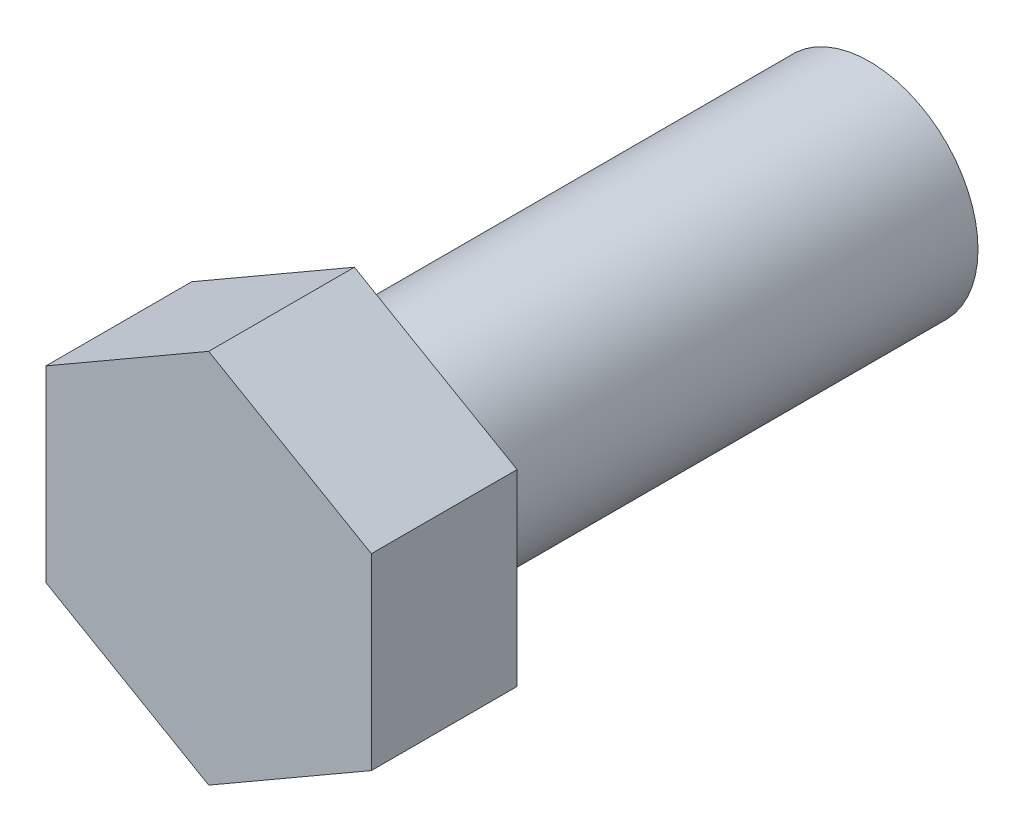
ISO-10303-21;
HEADER;
FILE_DESCRIPTION(('STEP AP214'),'2;1');
FILE_NAME('part.step','',(''),(''),'','','');
FILE_SCHEMA(('AUTOMOTIVE_DESIGN { 1 0 10303 214 1 1 1 1 }'));
ENDSEC;
DATA;
#1=APPLICATION_CONTEXT('core data for automotive mechanical design processes');
#2=APPLICATION_PROTOCOL_DEFINITION('international standard','automotive_design',2000,#1);
#3=PRODUCT_CONTEXT('',#1,'mechanical');
#4=PRODUCT('Part','Part','',(#3));
#5=PRODUCT_RELATED_PRODUCT_CATEGORY('part','',(#4));
#6=PRODUCT_DEFINITION_FORMATION('','',#4);
#7=PRODUCT_DEFINITION_CONTEXT('part definition',#1,'design');
#8=PRODUCT_DEFINITION('design','',#6,#7);
#9=PRODUCT_DEFINITION_SHAPE('','',#8);
#10=(LENGTH_UNIT() NAMED_UNIT(*) SI_UNIT(.MILLI.,.METRE.));
#11=(NAMED_UNIT(*) PLANE_ANGLE_UNIT() SI_UNIT($,.RADIAN.));
#12=(NAMED_UNIT(*) SI_UNIT($,.STERADIAN.) SOLID_ANGLE_UNIT());
#13=UNCERTAINTY_MEASURE_WITH_UNIT(LENGTH_MEASURE(1.E-05),#10,'distance_accuracy_value','');
#14=(GEOMETRIC_REPRESENTATION_CONTEXT(3) GLOBAL_UNCERTAINTY_ASSIGNED_CONTEXT((#13)) GLOBAL_UNIT_ASSIGNED_CONTEXT((#10,
#11,#12)) REPRESENTATION_CONTEXT('',''));
#15=CARTESIAN_POINT('',(0.,0.,0.));
#16=DIRECTION('',(0.,0.,1.));
#17=DIRECTION('',(1.,0.,0.));
#18=AXIS2_PLACEMENT_3D('',#15,#16,#17);
#19=CARTESIAN_POINT('',(76.2,43.9940905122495,68.2625));
#20=DIRECTION('',(-0.5,-0.866025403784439,0.));
#21=DIRECTION('',(0.866025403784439,-0.5,0.));
#22=AXIS2_PLACEMENT_3D('',#19,#20,#21);
#23=PLANE('',#22);
#24=DIRECTION('',(-0.866025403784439,0.5,0.));
#25=VECTOR('',#24,1.);
#26=CARTESIAN_POINT('',(76.2,43.9940905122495,0.));
#27=LINE('',#26,#25);
#28=CARTESIAN_POINT('',(76.2,43.9940905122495,0.));
#29=VERTEX_POINT('',#28);
#30=CARTESIAN_POINT('',(0.,87.988181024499,0.));
#31=VERTEX_POINT('',#30);
#32=EDGE_CURVE('E128',#29,#31,#27,.T.);
#33=ORIENTED_EDGE('',*,*,#32,.T.);
#34=DIRECTION('',(0.,0.,-1.));
#35=VECTOR('',#34,1.);
#36=CARTESIAN_POINT('',(0.,87.988181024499,68.2625));
#37=LINE('',#36,#35);
#38=CARTESIAN_POINT('',(0.,87.988181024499,68.2625));
#39=VERTEX_POINT('',#38);
#40=EDGE_CURVE('E11',#39,#31,#37,.T.);
#41=ORIENTED_EDGE('',*,*,#40,.F.);
#42=DIRECTION('',(-0.866025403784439,0.5,0.));
#43=VECTOR('',#42,1.);
#44=CARTESIAN_POINT('',(76.2,43.9940905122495,68.2625));
#45=LINE('',#44,#43);
#46=CARTESIAN_POINT('',(76.2,43.9940905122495,68.2625));
#47=VERTEX_POINT('',#46);
#48=EDGE_CURVE('E140',#47,#39,#45,.T.);
#49=ORIENTED_EDGE('',*,*,#48,.F.);
#50=DIRECTION('',(0.,0.,-1.));
#51=VECTOR('',#50,1.);
#52=CARTESIAN_POINT('',(76.2,43.9940905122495,68.2625));
#53=LINE('',#52,#51);
#54=EDGE_CURVE('E122',#47,#29,#53,.T.);
#55=ORIENTED_EDGE('',*,*,#54,.T.);
#56=EDGE_LOOP('',(#33,#41,#49,#55));
#57=FACE_BOUND('',#56,.T.);
#58=ADVANCED_FACE('F45',(#57),#23,.F.);
#59=CARTESIAN_POINT('',(0.,87.988181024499,68.2625));
#60=DIRECTION('',(0.5,-0.866025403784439,0.));
#61=DIRECTION('',(0.866025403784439,0.5,0.));
#62=AXIS2_PLACEMENT_3D('',#59,#60,#61);
#63=PLANE('',#62);
#64=DIRECTION('',(-0.866025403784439,-0.5,0.));
#65=VECTOR('',#64,1.);
#66=CARTESIAN_POINT('',(0.,87.988181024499,0.));
#67=LINE('',#66,#65);
#68=CARTESIAN_POINT('',(-76.2,43.9940905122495,0.));
#69=VERTEX_POINT('',#68);
#70=EDGE_CURVE('E129',#31,#69,#67,.T.);
#71=ORIENTED_EDGE('',*,*,#70,.T.);
#72=DIRECTION('',(0.,0.,-1.));
#73=VECTOR('',#72,1.);
#74=CARTESIAN_POINT('',(-76.2,43.9940905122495,68.2625));
#75=LINE('',#74,#73);
#76=CARTESIAN_POINT('',(-76.2,43.9940905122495,68.2625));
#77=VERTEX_POINT('',#76);
#78=EDGE_CURVE('E49',#77,#69,#75,.T.);
#79=ORIENTED_EDGE('',*,*,#78,.F.);
#80=DIRECTION('',(-0.866025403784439,-0.5,0.));
#81=VECTOR('',#80,1.);
#82=CARTESIAN_POINT('',(0.,87.988181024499,68.2625));
#83=LINE('',#82,#81);
#84=EDGE_CURVE('E94',#39,#77,#83,.T.);
#85=ORIENTED_EDGE('',*,*,#84,.F.);
#86=ORIENTED_EDGE('',*,*,#40,.T.);
#87=EDGE_LOOP('',(#71,#79,#85,#86));
#88=FACE_BOUND('',#87,.T.);
#89=ADVANCED_FACE('F163',(#88),#63,.F.);
#90=CARTESIAN_POINT('',(-76.2,43.9940905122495,68.2625));
#91=DIRECTION('',(1.,0.,0.));
#92=DIRECTION('',(0.,1.,0.));
#93=AXIS2_PLACEMENT_3D('',#90,#91,#92);
#94=PLANE('',#93);
#95=DIRECTION('',(0.,-1.,0.));
#96=VECTOR('',#95,1.);
#97=CARTESIAN_POINT('',(-76.2,43.9940905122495,0.));
#98=LINE('',#97,#96);
#99=CARTESIAN_POINT('',(-76.2,-43.9940905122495,0.));
#100=VERTEX_POINT('',#99);
#101=EDGE_CURVE('E135',#69,#100,#98,.T.);
#102=ORIENTED_EDGE('',*,*,#101,.T.);
#103=DIRECTION('',(0.,0.,-1.));
#104=VECTOR('',#103,1.);
#105=CARTESIAN_POINT('',(-76.2,-43.9940905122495,68.2625));
#106=LINE('',#105,#104);
#107=CARTESIAN_POINT('',(-76.2,-43.9940905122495,68.2625));
#108=VERTEX_POINT('',#107);
#109=EDGE_CURVE('E120',#108,#100,#106,.T.);
#110=ORIENTED_EDGE('',*,*,#109,.F.);
#111=DIRECTION('',(0.,-1.,0.));
#112=VECTOR('',#111,1.);
#113=CARTESIAN_POINT('',(-76.2,43.9940905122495,68.2625));
#114=LINE('',#113,#112);
#115=EDGE_CURVE('E106',#77,#108,#114,.T.);
#116=ORIENTED_EDGE('',*,*,#115,.F.);
#117=ORIENTED_EDGE('',*,*,#78,.T.);
#118=EDGE_LOOP('',(#102,#110,#116,#117));
#119=FACE_BOUND('',#118,.T.);
#120=ADVANCED_FACE('F142',(#119),#94,.F.);
#121=CARTESIAN_POINT('',(-76.2,-43.9940905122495,68.2625));
#122=DIRECTION('',(0.5,0.866025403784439,0.));
#123=DIRECTION('',(-0.866025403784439,0.5,0.));
#124=AXIS2_PLACEMENT_3D('',#121,#122,#123);
#125=PLANE('',#124);
#126=DIRECTION('',(0.866025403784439,-0.5,0.));
#127=VECTOR('',#126,1.);
#128=CARTESIAN_POINT('',(-76.2,-43.9940905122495,0.));
#129=LINE('',#128,#127);
#130=CARTESIAN_POINT('',(0.,-87.988181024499,0.));
#131=VERTEX_POINT('',#130);
#132=EDGE_CURVE('E118',#100,#131,#129,.T.);
#133=ORIENTED_EDGE('',*,*,#132,.T.);
#134=DIRECTION('',(0.,0.,-1.));
#135=VECTOR('',#134,1.);
#136=CARTESIAN_POINT('',(0.,-87.988181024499,68.2625));
#137=LINE('',#136,#135);
#138=CARTESIAN_POINT('',(0.,-87.988181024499,68.2625));
#139=VERTEX_POINT('',#138);
#140=EDGE_CURVE('E111',#139,#131,#137,.T.);
#141=ORIENTED_EDGE('',*,*,#140,.F.);
#142=DIRECTION('',(0.866025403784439,-0.5,0.));
#143=VECTOR('',#142,1.);
#144=CARTESIAN_POINT('',(-76.2,-43.9940905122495,68.2625));
#145=LINE('',#144,#143);
#146=EDGE_CURVE('E105',#108,#139,#145,.T.);
#147=ORIENTED_EDGE('',*,*,#146,.F.);
#148=ORIENTED_EDGE('',*,*,#109,.T.);
#149=EDGE_LOOP('',(#133,#141,#147,#148));
#150=FACE_BOUND('',#149,.T.);
#151=ADVANCED_FACE('F114',(#150),#125,.F.);
#152=CARTESIAN_POINT('',(0.,-87.988181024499,68.2625));
#153=DIRECTION('',(-0.5,0.866025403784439,0.));
#154=DIRECTION('',(-0.866025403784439,-0.5,0.));
#155=AXIS2_PLACEMENT_3D('',#152,#153,#154);
#156=PLANE('',#155);
#157=DIRECTION('',(0.866025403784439,0.5,0.));
#158=VECTOR('',#157,1.);
#159=CARTESIAN_POINT('',(0.,-87.988181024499,0.));
#160=LINE('',#159,#158);
#161=CARTESIAN_POINT('',(76.2,-43.9940905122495,0.));
#162=VERTEX_POINT('',#161);
#163=EDGE_CURVE('E83',#131,#162,#160,.T.);
#164=ORIENTED_EDGE('',*,*,#163,.T.);
#165=DIRECTION('',(0.,0.,-1.));
#166=VECTOR('',#165,1.);
#167=CARTESIAN_POINT('',(76.2,-43.9940905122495,68.2625));
#168=LINE('',#167,#166);
#169=CARTESIAN_POINT('',(76.2,-43.9940905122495,68.2625));
#170=VERTEX_POINT('',#169);
#171=EDGE_CURVE('E116',#170,#162,#168,.T.);
#172=ORIENTED_EDGE('',*,*,#171,.F.);
#173=DIRECTION('',(0.866025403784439,0.5,0.));
#174=VECTOR('',#173,1.);
#175=CARTESIAN_POINT('',(0.,-87.988181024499,68.2625));
#176=LINE('',#175,#174);
#177=EDGE_CURVE('E108',#139,#170,#176,.T.);
#178=ORIENTED_EDGE('',*,*,#177,.F.);
#179=ORIENTED_EDGE('',*,*,#140,.T.);
#180=EDGE_LOOP('',(#164,#172,#178,#179));
#181=FACE_BOUND('',#180,.T.);
#182=ADVANCED_FACE('F119',(#181),#156,.F.);
#183=CARTESIAN_POINT('',(76.2,-43.9940905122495,68.2625));
#184=DIRECTION('',(-1.,0.,0.));
#185=DIRECTION('',(0.,0.,1.));
#186=AXIS2_PLACEMENT_3D('',#183,#184,#185);
#187=PLANE('',#186);
#188=DIRECTION('',(0.,1.,0.));
#189=VECTOR('',#188,1.);
#190=CARTESIAN_POINT('',(76.2,-43.9940905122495,0.));
#191=LINE('',#190,#189);
#192=EDGE_CURVE('E90',#162,#29,#191,.T.);
#193=ORIENTED_EDGE('',*,*,#192,.T.);
#194=ORIENTED_EDGE('',*,*,#54,.F.);
#195=DIRECTION('',(0.,1.,0.));
#196=VECTOR('',#195,1.);
#197=CARTESIAN_POINT('',(76.2,-43.9940905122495,68.2625));
#198=LINE('',#197,#196);
#199=EDGE_CURVE('E59',#170,#47,#198,.T.);
#200=ORIENTED_EDGE('',*,*,#199,.F.);
#201=ORIENTED_EDGE('',*,*,#171,.T.);
#202=EDGE_LOOP('',(#193,#194,#200,#201));
#203=FACE_BOUND('',#202,.T.);
#204=ADVANCED_FACE('F148',(#203),#187,.F.);
#205=CARTESIAN_POINT('',(0.,0.,68.2625));
#206=DIRECTION('',(0.,0.,1.));
#207=DIRECTION('',(1.,0.,0.));
#208=AXIS2_PLACEMENT_3D('',#205,#206,#207);
#209=PLANE('',#208);
#210=ORIENTED_EDGE('',*,*,#48,.T.);
#211=ORIENTED_EDGE('',*,*,#84,.T.);
#212=ORIENTED_EDGE('',*,*,#115,.T.);
#213=ORIENTED_EDGE('',*,*,#146,.T.);
#214=ORIENTED_EDGE('',*,*,#177,.T.);
#215=ORIENTED_EDGE('',*,*,#199,.T.);
#216=EDGE_LOOP('',(#210,#211,#212,#213,#214,#215));
#217=FACE_BOUND('',#216,.T.);
#218=ADVANCED_FACE('F101',(#217),#209,.T.);
#219=CARTESIAN_POINT('',(0.,0.,0.));
#220=DIRECTION('',(0.,0.,1.));
#221=DIRECTION('',(1.,0.,0.));
#222=AXIS2_PLACEMENT_3D('',#219,#220,#221);
#223=PLANE('',#222);
#224=CARTESIAN_POINT('',(0.,0.,0.));
#225=DIRECTION('',(0.,0.,1.));
#226=DIRECTION('',(1.,0.,0.));
#227=AXIS2_PLACEMENT_3D('',#224,#225,#226);
#228=CIRCLE('',#227,50.8);
#229=CARTESIAN_POINT('',(50.8,0.,0.));
#230=VERTEX_POINT('',#229);
#231=EDGE_CURVE('E222',#230,#230,#228,.T.);
#232=ORIENTED_EDGE('',*,*,#231,.T.);
#233=EDGE_LOOP('',(#232));
#234=FACE_BOUND('',#233,.T.);
#235=ORIENTED_EDGE('',*,*,#32,.F.);
#236=ORIENTED_EDGE('',*,*,#192,.F.);
#237=ORIENTED_EDGE('',*,*,#163,.F.);
#238=ORIENTED_EDGE('',*,*,#132,.F.);
#239=ORIENTED_EDGE('',*,*,#101,.F.);
#240=ORIENTED_EDGE('',*,*,#70,.F.);
#241=EDGE_LOOP('',(#235,#236,#237,#238,#239,#240));
#242=FACE_BOUND('',#241,.T.);
#243=ADVANCED_FACE('F147',(#234,#242),#223,.F.);
#244=CARTESIAN_POINT('',(0.,0.,-241.3));
#245=DIRECTION('',(0.,0.,1.));
#246=DIRECTION('',(1.,0.,0.));
#247=AXIS2_PLACEMENT_3D('',#244,#245,#246);
#248=CYLINDRICAL_SURFACE('',#247,50.8);
#249=CARTESIAN_POINT('',(0.,0.,-241.3));
#250=DIRECTION('',(0.,0.,1.));
#251=DIRECTION('',(1.,0.,0.));
#252=AXIS2_PLACEMENT_3D('',#249,#250,#251);
#253=CIRCLE('',#252,50.8);
#254=CARTESIAN_POINT('',(50.8,0.,-241.3));
#255=VERTEX_POINT('',#254);
#256=EDGE_CURVE('E127',#255,#255,#253,.T.);
#257=CARTESIAN_POINT('',(50.8,0.,-241.3));
#258=CARTESIAN_POINT('',(50.8,0.,-238.786458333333));
#259=CARTESIAN_POINT('',(50.8,0.,-236.272916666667));
#260=CARTESIAN_POINT('',(50.8,0.,-231.245833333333));
#261=CARTESIAN_POINT('',(50.8,0.,-228.732291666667));
#262=CARTESIAN_POINT('',(50.8,0.,-223.705208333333));
#263=CARTESIAN_POINT('',(50.8,0.,-221.191666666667));
#264=CARTESIAN_POINT('',(50.8,0.,-216.164583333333));
#265=CARTESIAN_POINT('',(50.8,0.,-213.651041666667));
#266=CARTESIAN_POINT('',(50.8,0.,-208.623958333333));
#267=CARTESIAN_POINT('',(50.8,0.,-206.110416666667));
#268=CARTESIAN_POINT('',(50.8,0.,-201.083333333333));
#269=CARTESIAN_POINT('',(50.8,0.,-198.569791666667));
#270=CARTESIAN_POINT('',(50.8,0.,-193.542708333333));
#271=CARTESIAN_POINT('',(50.8,0.,-191.029166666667));
#272=CARTESIAN_POINT('',(50.8,0.,-186.002083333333));
#273=CARTESIAN_POINT('',(50.8,0.,-183.488541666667));
#274=CARTESIAN_POINT('',(50.8,0.,-178.461458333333));
#275=CARTESIAN_POINT('',(50.8,0.,-175.947916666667));
#276=CARTESIAN_POINT('',(50.8,0.,-170.920833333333));
#277=CARTESIAN_POINT('',(50.8,0.,-168.407291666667));
#278=CARTESIAN_POINT('',(50.8,0.,-163.380208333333));
#279=CARTESIAN_POINT('',(50.8,0.,-160.866666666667));
#280=CARTESIAN_POINT('',(50.8,0.,-155.839583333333));
#281=CARTESIAN_POINT('',(50.8,0.,-153.326041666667));
#282=CARTESIAN_POINT('',(50.8,0.,-148.298958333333));
#283=CARTESIAN_POINT('',(50.8,0.,-145.785416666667));
#284=CARTESIAN_POINT('',(50.8,0.,-140.758333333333));
#285=CARTESIAN_POINT('',(50.8,0.,-138.244791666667));
#286=CARTESIAN_POINT('',(50.8,0.,-133.217708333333));
#287=CARTESIAN_POINT('',(50.8,0.,-130.704166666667));
#288=CARTESIAN_POINT('',(50.8,0.,-125.677083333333));
#289=CARTESIAN_POINT('',(50.8,0.,-123.163541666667));
#290=CARTESIAN_POINT('',(50.8,0.,-118.136458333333));
#291=CARTESIAN_POINT('',(50.8,0.,-115.622916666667));
#292=CARTESIAN_POINT('',(50.8,0.,-110.595833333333));
#293=CARTESIAN_POINT('',(50.8,0.,-108.082291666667));
#294=CARTESIAN_POINT('',(50.8,0.,-103.055208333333));
#295=CARTESIAN_POINT('',(50.8,0.,-100.541666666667));
#296=CARTESIAN_POINT('',(50.8,0.,-95.5145833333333));
#297=CARTESIAN_POINT('',(50.8,0.,-93.0010416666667));
#298=CARTESIAN_POINT('',(50.8,0.,-87.9739583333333));
#299=CARTESIAN_POINT('',(50.8,0.,-85.4604166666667));
#300=CARTESIAN_POINT('',(50.8,0.,-80.4333333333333));
#301=CARTESIAN_POINT('',(50.8,0.,-77.9197916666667));
#302=CARTESIAN_POINT('',(50.8,0.,-72.8927083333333));
#303=CARTESIAN_POINT('',(50.8,0.,-70.3791666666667));
#304=CARTESIAN_POINT('',(50.8,0.,-65.3520833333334));
#305=CARTESIAN_POINT('',(50.8,0.,-62.8385416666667));
#306=CARTESIAN_POINT('',(50.8,0.,-57.8114583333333));
#307=CARTESIAN_POINT('',(50.8,0.,-55.2979166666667));
#308=CARTESIAN_POINT('',(50.8,0.,-50.2708333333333));
#309=CARTESIAN_POINT('',(50.8,0.,-47.7572916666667));
#310=CARTESIAN_POINT('',(50.8,0.,-42.7302083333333));
#311=CARTESIAN_POINT('',(50.8,0.,-40.2166666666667));
#312=CARTESIAN_POINT('',(50.8,0.,-35.1895833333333));
#313=CARTESIAN_POINT('',(50.8,0.,-32.6760416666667));
#314=CARTESIAN_POINT('',(50.8,0.,-27.6489583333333));
#315=CARTESIAN_POINT('',(50.8,0.,-25.1354166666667));
#316=CARTESIAN_POINT('',(50.8,0.,-20.1083333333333));
#317=CARTESIAN_POINT('',(50.8,0.,-17.5947916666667));
#318=CARTESIAN_POINT('',(50.8,0.,-12.5677083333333));
#319=CARTESIAN_POINT('',(50.8,0.,-10.0541666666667));
#320=CARTESIAN_POINT('',(50.8,0.,-5.02708333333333));
#321=CARTESIAN_POINT('',(50.8,0.,-2.51354166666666));
#322=CARTESIAN_POINT('',(50.8,0.,0.));
#323=B_SPLINE_CURVE_WITH_KNOTS('',3,(#257,#258,#259,#260,#261,#262,#263,#264,#265,#266,#267,
#268,#269,#270,#271,#272,#273,#274,#275,#276,#277,#278,#279,#280,#281,#282,#283,#284,#285,#286,
#287,#288,#289,#290,#291,#292,#293,#294,#295,#296,#297,#298,#299,#300,#301,#302,#303,#304,#305,
#306,#307,#308,#309,#310,#311,#312,#313,#314,#315,#316,#317,#318,#319,#320,#321,#322),
.UNSPECIFIED.,.F.,.F.,(4,2,2,2,2,2,2,2,2,2,2,2,2,2,2,2,2,2,2,2,2,2,2,2,2,2,2,2,2,2,2,2,4),(0.,
7.540625,15.08125,22.621875,30.1625,37.703125,45.24375,52.784375,60.325,67.865625,75.40625,
82.946875,90.4875,98.028125,105.56875,113.109375,120.65,128.190625,135.73125,143.271875,
150.8125,158.353125,165.89375,173.434375,180.975,188.515625,196.05625,203.596875,211.1375,
218.678125,226.21875,233.759375,241.3),.UNSPECIFIED.);
#324=EDGE_CURVE('BSEAM199',#255,#230,#323,.T.);
#325=ORIENTED_EDGE('',*,*,#256,.T.);
#326=ORIENTED_EDGE('',*,*,#231,.F.);
#327=ORIENTED_EDGE('',*,*,#324,.T.);
#328=ORIENTED_EDGE('',*,*,#324,.F.);
#329=EDGE_LOOP('',(#325,#327,#326,#328));
#330=FACE_BOUND('',#329,.T.);
#331=ADVANCED_FACE('F199',(#330),#248,.T.);
#332=CARTESIAN_POINT('',(0.,0.,-241.3));
#333=DIRECTION('',(0.,0.,1.));
#334=DIRECTION('',(1.,0.,0.));
#335=AXIS2_PLACEMENT_3D('',#332,#333,#334);
#336=PLANE('',#335);
#337=ORIENTED_EDGE('',*,*,#256,.F.);
#338=EDGE_LOOP('',(#337));
#339=FACE_BOUND('',#338,.T.);
#340=ADVANCED_FACE('F207',(#339),#336,.F.);
#341=CLOSED_SHELL('',(#58,#89,#120,#151,#182,#204,#218,#243,#331,#340));
#342=MANIFOLD_SOLID_BREP('B2',#341);
#343=ADVANCED_BREP_SHAPE_REPRESENTATION('',(#18,#342),#14);
#344=SHAPE_DEFINITION_REPRESENTATION(#9,#343);
ENDSEC;
END-ISO-10303-21;
